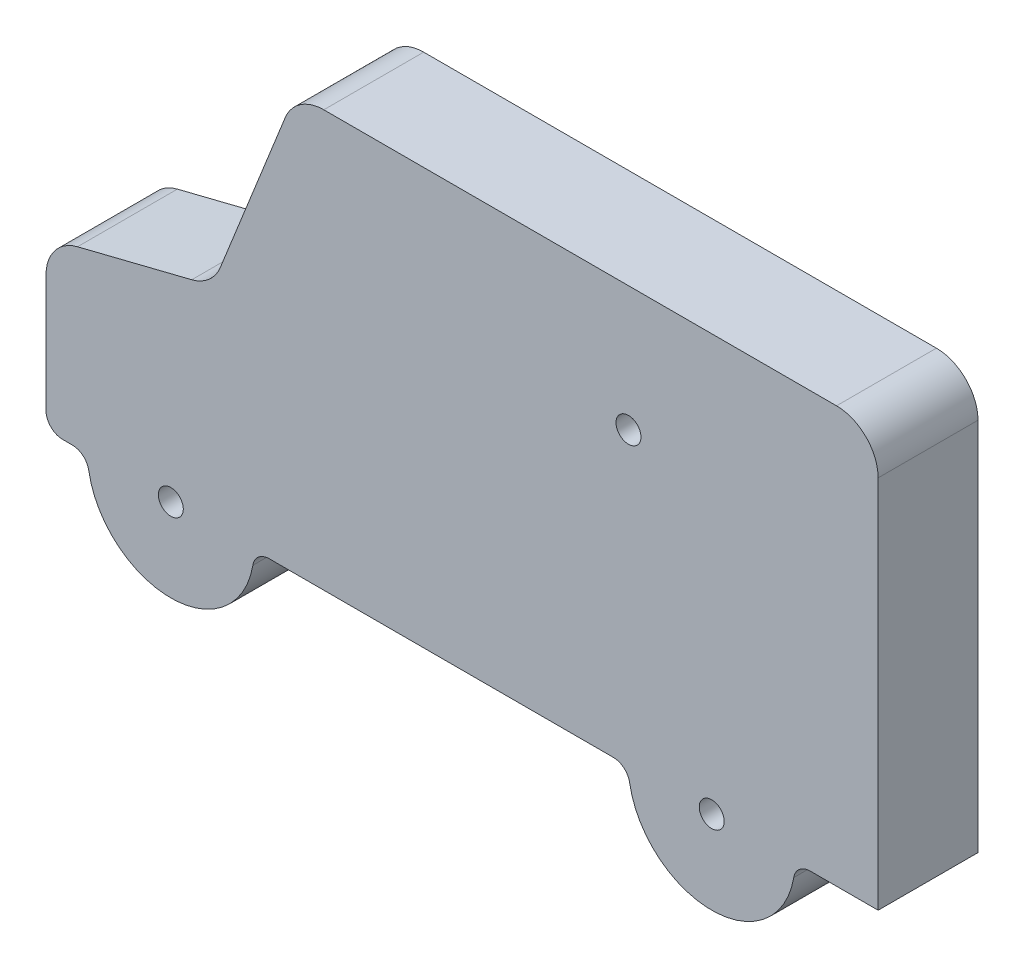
ISO-10303-21;
HEADER;
FILE_DESCRIPTION(('STEP AP214'),'2;1');
FILE_NAME('part.step','',(''),(''),'','','');
FILE_SCHEMA(('AUTOMOTIVE_DESIGN { 1 0 10303 214 1 1 1 1 }'));
ENDSEC;
DATA;
#1=APPLICATION_CONTEXT('core data for automotive mechanical design processes');
#2=APPLICATION_PROTOCOL_DEFINITION('international standard','automotive_design',2000,#1);
#3=PRODUCT_CONTEXT('',#1,'mechanical');
#4=PRODUCT('Part','Part','',(#3));
#5=PRODUCT_RELATED_PRODUCT_CATEGORY('part','',(#4));
#6=PRODUCT_DEFINITION_FORMATION('','',#4);
#7=PRODUCT_DEFINITION_CONTEXT('part definition',#1,'design');
#8=PRODUCT_DEFINITION('design','',#6,#7);
#9=PRODUCT_DEFINITION_SHAPE('','',#8);
#10=(LENGTH_UNIT() NAMED_UNIT(*) SI_UNIT(.MILLI.,.METRE.));
#11=(NAMED_UNIT(*) PLANE_ANGLE_UNIT() SI_UNIT($,.RADIAN.));
#12=(NAMED_UNIT(*) SI_UNIT($,.STERADIAN.) SOLID_ANGLE_UNIT());
#13=UNCERTAINTY_MEASURE_WITH_UNIT(LENGTH_MEASURE(1.E-05),#10,'distance_accuracy_value','');
#14=(GEOMETRIC_REPRESENTATION_CONTEXT(3) GLOBAL_UNCERTAINTY_ASSIGNED_CONTEXT((#13)) GLOBAL_UNIT_ASSIGNED_CONTEXT((#10,
#11,#12)) REPRESENTATION_CONTEXT('',''));
#15=CARTESIAN_POINT('',(0.,0.,0.));
#16=DIRECTION('',(0.,0.,1.));
#17=DIRECTION('',(1.,0.,0.));
#18=AXIS2_PLACEMENT_3D('',#15,#16,#17);
#19=CARTESIAN_POINT('',(33.3851648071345,45.,12.));
#20=DIRECTION('',(0.,0.,-1.));
#21=DIRECTION('',(-1.,0.,0.));
#22=AXIS2_PLACEMENT_3D('',#19,#20,#21);
#23=PLANE('',#22);
#24=CARTESIAN_POINT('',(70.,35.,12.));
#25=DIRECTION('',(0.,0.,1.));
#26=DIRECTION('',(1.,0.,0.));
#27=AXIS2_PLACEMENT_3D('',#24,#25,#26);
#28=CIRCLE('',#27,1.5);
#29=CARTESIAN_POINT('',(71.5,35.,12.));
#30=VERTEX_POINT('',#29);
#31=EDGE_CURVE('E417',#30,#30,#28,.T.);
#32=ORIENTED_EDGE('',*,*,#31,.F.);
#33=EDGE_LOOP('',(#32));
#34=FACE_BOUND('',#33,.T.);
#35=CARTESIAN_POINT('',(15.,0.,12.));
#36=DIRECTION('',(0.,0.,1.));
#37=DIRECTION('',(1.,0.,0.));
#38=AXIS2_PLACEMENT_3D('',#35,#36,#37);
#39=CIRCLE('',#38,1.5);
#40=CARTESIAN_POINT('',(16.5,0.,12.));
#41=VERTEX_POINT('',#40);
#42=EDGE_CURVE('E177',#41,#41,#39,.T.);
#43=ORIENTED_EDGE('',*,*,#42,.F.);
#44=EDGE_LOOP('',(#43));
#45=FACE_BOUND('',#44,.T.);
#46=CARTESIAN_POINT('',(33.3851648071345,45.,12.));
#47=DIRECTION('',(0.,0.,1.));
#48=DIRECTION('',(-1.,0.,0.));
#49=AXIS2_PLACEMENT_3D('',#46,#47,#48);
#50=CIRCLE('',#49,5.);
#51=CARTESIAN_POINT('',(33.3851648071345,50.,12.));
#52=VERTEX_POINT('',#51);
#53=CARTESIAN_POINT('',(28.7427813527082,46.8569533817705,12.));
#54=VERTEX_POINT('',#53);
#55=EDGE_CURVE('E217',#52,#54,#50,.T.);
#56=ORIENTED_EDGE('',*,*,#55,.T.);
#57=DIRECTION('',(-0.371390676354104,-0.928476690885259,0.));
#58=VECTOR('',#57,1.);
#59=CARTESIAN_POINT('',(20.9494812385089,27.3737030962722,12.));
#60=LINE('',#59,#58);
#61=CARTESIAN_POINT('',(20.9494812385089,27.3737030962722,12.));
#62=VERTEX_POINT('',#61);
#63=EDGE_CURVE('E172',#54,#62,#60,.T.);
#64=ORIENTED_EDGE('',*,*,#63,.T.);
#65=CARTESIAN_POINT('',(16.3070977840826,29.2306564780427,12.));
#66=DIRECTION('',(0.,0.,-1.));
#67=DIRECTION('',(1.,0.,0.));
#68=AXIS2_PLACEMENT_3D('',#65,#66,#67);
#69=CIRCLE('',#68,5.);
#70=CARTESIAN_POINT('',(17.5197759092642,24.3799439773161,12.));
#71=VERTEX_POINT('',#70);
#72=EDGE_CURVE('E220',#62,#71,#69,.T.);
#73=ORIENTED_EDGE('',*,*,#72,.T.);
#74=DIRECTION('',(-0.970142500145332,-0.242535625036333,0.));
#75=VECTOR('',#74,1.);
#76=CARTESIAN_POINT('',(3.78732187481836,20.9468304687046,12.));
#77=LINE('',#76,#75);
#78=CARTESIAN_POINT('',(3.78732187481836,20.9468304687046,12.));
#79=VERTEX_POINT('',#78);
#80=EDGE_CURVE('E222',#71,#79,#77,.T.);
#81=ORIENTED_EDGE('',*,*,#80,.T.);
#82=CARTESIAN_POINT('',(5.,16.0961179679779,12.));
#83=DIRECTION('',(0.,0.,1.));
#84=DIRECTION('',(1.,0.,0.));
#85=AXIS2_PLACEMENT_3D('',#82,#83,#84);
#86=CIRCLE('',#85,5.);
#87=CARTESIAN_POINT('',(0.,16.0961179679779,12.));
#88=VERTEX_POINT('',#87);
#89=EDGE_CURVE('E224',#79,#88,#86,.T.);
#90=ORIENTED_EDGE('',*,*,#89,.T.);
#91=DIRECTION('',(0.,-1.,0.));
#92=VECTOR('',#91,1.);
#93=CARTESIAN_POINT('',(0.,2.00000000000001,12.));
#94=LINE('',#93,#92);
#95=CARTESIAN_POINT('',(0.,2.00000000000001,12.));
#96=VERTEX_POINT('',#95);
#97=EDGE_CURVE('E226',#88,#96,#94,.T.);
#98=ORIENTED_EDGE('',*,*,#97,.T.);
#99=CARTESIAN_POINT('',(2.,2.,12.));
#100=DIRECTION('',(0.,0.,1.));
#101=DIRECTION('',(-1.,0.,0.));
#102=AXIS2_PLACEMENT_3D('',#99,#100,#101);
#103=CIRCLE('',#102,2.);
#104=CARTESIAN_POINT('',(2.00000000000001,0.,12.));
#105=VERTEX_POINT('',#104);
#106=EDGE_CURVE('E228',#96,#105,#103,.T.);
#107=ORIENTED_EDGE('',*,*,#106,.T.);
#108=DIRECTION('',(1.,0.,0.));
#109=VECTOR('',#108,1.);
#110=CARTESIAN_POINT('',(2.00000000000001,0.,12.));
#111=LINE('',#110,#109);
#112=CARTESIAN_POINT('',(3.16784043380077,0.,12.));
#113=VERTEX_POINT('',#112);
#114=EDGE_CURVE('E230',#105,#113,#111,.T.);
#115=ORIENTED_EDGE('',*,*,#114,.T.);
#116=CARTESIAN_POINT('',(3.16784043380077,-2.,12.));
#117=DIRECTION('',(0.,0.,-1.));
#118=DIRECTION('',(1.,0.,0.));
#119=AXIS2_PLACEMENT_3D('',#116,#117,#118);
#120=CIRCLE('',#119,2.);
#121=CARTESIAN_POINT('',(5.13986702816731,-1.66666666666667,12.));
#122=VERTEX_POINT('',#121);
#123=EDGE_CURVE('E232',#113,#122,#120,.T.);
#124=ORIENTED_EDGE('',*,*,#123,.T.);
#125=CARTESIAN_POINT('',(15.,0.,12.));
#126=DIRECTION('',(0.,0.,1.));
#127=DIRECTION('',(1.,0.,0.));
#128=AXIS2_PLACEMENT_3D('',#125,#126,#127);
#129=CIRCLE('',#128,10.);
#130=CARTESIAN_POINT('',(24.8601329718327,-1.66666666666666,12.));
#131=VERTEX_POINT('',#130);
#132=EDGE_CURVE('E234',#122,#131,#129,.T.);
#133=ORIENTED_EDGE('',*,*,#132,.T.);
#134=CARTESIAN_POINT('',(26.8321595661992,-2.,12.));
#135=DIRECTION('',(0.,0.,-1.));
#136=DIRECTION('',(1.,0.,0.));
#137=AXIS2_PLACEMENT_3D('',#134,#135,#136);
#138=CIRCLE('',#137,2.);
#139=CARTESIAN_POINT('',(26.8321595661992,0.,12.));
#140=VERTEX_POINT('',#139);
#141=EDGE_CURVE('E236',#131,#140,#138,.T.);
#142=ORIENTED_EDGE('',*,*,#141,.T.);
#143=DIRECTION('',(1.,0.,0.));
#144=VECTOR('',#143,1.);
#145=CARTESIAN_POINT('',(26.8321595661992,0.,12.));
#146=LINE('',#145,#144);
#147=CARTESIAN_POINT('',(68.1678404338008,0.,12.));
#148=VERTEX_POINT('',#147);
#149=EDGE_CURVE('E238',#140,#148,#146,.T.);
#150=ORIENTED_EDGE('',*,*,#149,.T.);
#151=CARTESIAN_POINT('',(68.1678404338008,-2.,12.));
#152=DIRECTION('',(0.,0.,-1.));
#153=DIRECTION('',(-1.,0.,0.));
#154=AXIS2_PLACEMENT_3D('',#151,#152,#153);
#155=CIRCLE('',#154,2.);
#156=CARTESIAN_POINT('',(70.1398670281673,-1.66666666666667,12.));
#157=VERTEX_POINT('',#156);
#158=EDGE_CURVE('E240',#148,#157,#155,.T.);
#159=ORIENTED_EDGE('',*,*,#158,.T.);
#160=CARTESIAN_POINT('',(80.,0.,12.));
#161=DIRECTION('',(0.,0.,1.));
#162=DIRECTION('',(1.,0.,0.));
#163=AXIS2_PLACEMENT_3D('',#160,#161,#162);
#164=CIRCLE('',#163,10.);
#165=CARTESIAN_POINT('',(89.8601329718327,-1.66666666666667,12.));
#166=VERTEX_POINT('',#165);
#167=EDGE_CURVE('E242',#157,#166,#164,.T.);
#168=ORIENTED_EDGE('',*,*,#167,.T.);
#169=CARTESIAN_POINT('',(91.8321595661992,-2.,12.));
#170=DIRECTION('',(0.,0.,-1.));
#171=DIRECTION('',(1.,0.,0.));
#172=AXIS2_PLACEMENT_3D('',#169,#170,#171);
#173=CIRCLE('',#172,2.);
#174=CARTESIAN_POINT('',(91.8321595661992,0.,12.));
#175=VERTEX_POINT('',#174);
#176=EDGE_CURVE('E244',#166,#175,#173,.T.);
#177=ORIENTED_EDGE('',*,*,#176,.T.);
#178=DIRECTION('',(1.,0.,0.));
#179=VECTOR('',#178,1.);
#180=CARTESIAN_POINT('',(91.8321595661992,0.,12.));
#181=LINE('',#180,#179);
#182=CARTESIAN_POINT('',(100.,0.,12.));
#183=VERTEX_POINT('',#182);
#184=EDGE_CURVE('E246',#175,#183,#181,.T.);
#185=ORIENTED_EDGE('',*,*,#184,.T.);
#186=DIRECTION('',(0.,1.,0.));
#187=VECTOR('',#186,1.);
#188=CARTESIAN_POINT('',(100.,0.,12.));
#189=LINE('',#188,#187);
#190=CARTESIAN_POINT('',(100.,45.,12.));
#191=VERTEX_POINT('',#190);
#192=EDGE_CURVE('E248',#183,#191,#189,.T.);
#193=ORIENTED_EDGE('',*,*,#192,.T.);
#194=CARTESIAN_POINT('',(95.,45.,12.));
#195=DIRECTION('',(0.,0.,1.));
#196=DIRECTION('',(-1.,0.,0.));
#197=AXIS2_PLACEMENT_3D('',#194,#195,#196);
#198=CIRCLE('',#197,5.);
#199=CARTESIAN_POINT('',(95.,50.,12.));
#200=VERTEX_POINT('',#199);
#201=EDGE_CURVE('E47',#191,#200,#198,.T.);
#202=ORIENTED_EDGE('',*,*,#201,.T.);
#203=DIRECTION('',(-1.,0.,0.));
#204=VECTOR('',#203,1.);
#205=CARTESIAN_POINT('',(33.3851648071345,50.,12.));
#206=LINE('',#205,#204);
#207=EDGE_CURVE('E42',#200,#52,#206,.T.);
#208=ORIENTED_EDGE('',*,*,#207,.T.);
#209=EDGE_LOOP('',(#56,#64,#73,#81,#90,#98,#107,#115,#124,#133,#142,#150,#159,#168,#177,#185,
#193,#202,#208));
#210=FACE_BOUND('',#209,.T.);
#211=CARTESIAN_POINT('',(80.,0.,12.));
#212=DIRECTION('',(0.,0.,1.));
#213=DIRECTION('',(1.,0.,0.));
#214=AXIS2_PLACEMENT_3D('',#211,#212,#213);
#215=CIRCLE('',#214,1.5);
#216=CARTESIAN_POINT('',(81.5,0.,12.));
#217=VERTEX_POINT('',#216);
#218=EDGE_CURVE('E420',#217,#217,#215,.T.);
#219=ORIENTED_EDGE('',*,*,#218,.F.);
#220=EDGE_LOOP('',(#219));
#221=FACE_BOUND('',#220,.T.);
#222=ADVANCED_FACE('F27',(#34,#45,#210,#221),#23,.F.);
#223=CARTESIAN_POINT('',(33.3851648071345,45.,0.));
#224=DIRECTION('',(0.,0.,-1.));
#225=DIRECTION('',(-1.,0.,0.));
#226=AXIS2_PLACEMENT_3D('',#223,#224,#225);
#227=PLANE('',#226);
#228=CARTESIAN_POINT('',(15.,0.,0.));
#229=DIRECTION('',(0.,0.,1.));
#230=DIRECTION('',(1.,0.,0.));
#231=AXIS2_PLACEMENT_3D('',#228,#229,#230);
#232=CIRCLE('',#231,1.5);
#233=CARTESIAN_POINT('',(16.5,0.,0.));
#234=VERTEX_POINT('',#233);
#235=EDGE_CURVE('E180',#234,#234,#232,.T.);
#236=ORIENTED_EDGE('',*,*,#235,.T.);
#237=EDGE_LOOP('',(#236));
#238=FACE_BOUND('',#237,.T.);
#239=CARTESIAN_POINT('',(33.3851648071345,45.,0.));
#240=DIRECTION('',(0.,0.,1.));
#241=DIRECTION('',(-1.,0.,0.));
#242=AXIS2_PLACEMENT_3D('',#239,#240,#241);
#243=CIRCLE('',#242,5.);
#244=CARTESIAN_POINT('',(33.3851648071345,50.,0.));
#245=VERTEX_POINT('',#244);
#246=CARTESIAN_POINT('',(28.7427813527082,46.8569533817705,0.));
#247=VERTEX_POINT('',#246);
#248=EDGE_CURVE('E163',#245,#247,#243,.T.);
#249=ORIENTED_EDGE('',*,*,#248,.F.);
#250=DIRECTION('',(-1.,0.,0.));
#251=VECTOR('',#250,1.);
#252=CARTESIAN_POINT('',(33.3851648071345,50.,0.));
#253=LINE('',#252,#251);
#254=CARTESIAN_POINT('',(95.,50.,0.));
#255=VERTEX_POINT('',#254);
#256=EDGE_CURVE('E215',#255,#245,#253,.T.);
#257=ORIENTED_EDGE('',*,*,#256,.F.);
#258=CARTESIAN_POINT('',(95.,45.,0.));
#259=DIRECTION('',(0.,0.,1.));
#260=DIRECTION('',(-1.,0.,0.));
#261=AXIS2_PLACEMENT_3D('',#258,#259,#260);
#262=CIRCLE('',#261,5.);
#263=CARTESIAN_POINT('',(100.,45.,0.));
#264=VERTEX_POINT('',#263);
#265=EDGE_CURVE('E213',#264,#255,#262,.T.);
#266=ORIENTED_EDGE('',*,*,#265,.F.);
#267=DIRECTION('',(0.,1.,0.));
#268=VECTOR('',#267,1.);
#269=CARTESIAN_POINT('',(100.,0.,0.));
#270=LINE('',#269,#268);
#271=CARTESIAN_POINT('',(100.,0.,0.));
#272=VERTEX_POINT('',#271);
#273=EDGE_CURVE('E211',#272,#264,#270,.T.);
#274=ORIENTED_EDGE('',*,*,#273,.F.);
#275=DIRECTION('',(1.,0.,0.));
#276=VECTOR('',#275,1.);
#277=CARTESIAN_POINT('',(91.8321595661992,0.,0.));
#278=LINE('',#277,#276);
#279=CARTESIAN_POINT('',(91.8321595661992,0.,0.));
#280=VERTEX_POINT('',#279);
#281=EDGE_CURVE('E209',#280,#272,#278,.T.);
#282=ORIENTED_EDGE('',*,*,#281,.F.);
#283=CARTESIAN_POINT('',(91.8321595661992,-2.,0.));
#284=DIRECTION('',(0.,0.,-1.));
#285=DIRECTION('',(1.,0.,0.));
#286=AXIS2_PLACEMENT_3D('',#283,#284,#285);
#287=CIRCLE('',#286,2.);
#288=CARTESIAN_POINT('',(89.8601329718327,-1.66666666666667,0.));
#289=VERTEX_POINT('',#288);
#290=EDGE_CURVE('E207',#289,#280,#287,.T.);
#291=ORIENTED_EDGE('',*,*,#290,.F.);
#292=CARTESIAN_POINT('',(80.,0.,0.));
#293=DIRECTION('',(0.,0.,1.));
#294=DIRECTION('',(1.,0.,0.));
#295=AXIS2_PLACEMENT_3D('',#292,#293,#294);
#296=CIRCLE('',#295,10.);
#297=CARTESIAN_POINT('',(70.1398670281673,-1.66666666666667,0.));
#298=VERTEX_POINT('',#297);
#299=EDGE_CURVE('E205',#298,#289,#296,.T.);
#300=ORIENTED_EDGE('',*,*,#299,.F.);
#301=CARTESIAN_POINT('',(68.1678404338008,-2.,0.));
#302=DIRECTION('',(0.,0.,-1.));
#303=DIRECTION('',(-1.,0.,0.));
#304=AXIS2_PLACEMENT_3D('',#301,#302,#303);
#305=CIRCLE('',#304,2.);
#306=CARTESIAN_POINT('',(68.1678404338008,0.,0.));
#307=VERTEX_POINT('',#306);
#308=EDGE_CURVE('E203',#307,#298,#305,.T.);
#309=ORIENTED_EDGE('',*,*,#308,.F.);
#310=DIRECTION('',(1.,0.,0.));
#311=VECTOR('',#310,1.);
#312=CARTESIAN_POINT('',(26.8321595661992,0.,0.));
#313=LINE('',#312,#311);
#314=CARTESIAN_POINT('',(26.8321595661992,0.,0.));
#315=VERTEX_POINT('',#314);
#316=EDGE_CURVE('E201',#315,#307,#313,.T.);
#317=ORIENTED_EDGE('',*,*,#316,.F.);
#318=CARTESIAN_POINT('',(26.8321595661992,-2.,0.));
#319=DIRECTION('',(0.,0.,-1.));
#320=DIRECTION('',(1.,0.,0.));
#321=AXIS2_PLACEMENT_3D('',#318,#319,#320);
#322=CIRCLE('',#321,2.);
#323=CARTESIAN_POINT('',(24.8601329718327,-1.66666666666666,0.));
#324=VERTEX_POINT('',#323);
#325=EDGE_CURVE('E199',#324,#315,#322,.T.);
#326=ORIENTED_EDGE('',*,*,#325,.F.);
#327=CARTESIAN_POINT('',(15.,0.,0.));
#328=DIRECTION('',(0.,0.,1.));
#329=DIRECTION('',(1.,0.,0.));
#330=AXIS2_PLACEMENT_3D('',#327,#328,#329);
#331=CIRCLE('',#330,10.);
#332=CARTESIAN_POINT('',(5.13986702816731,-1.66666666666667,0.));
#333=VERTEX_POINT('',#332);
#334=EDGE_CURVE('E197',#333,#324,#331,.T.);
#335=ORIENTED_EDGE('',*,*,#334,.F.);
#336=CARTESIAN_POINT('',(3.16784043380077,-2.,0.));
#337=DIRECTION('',(0.,0.,-1.));
#338=DIRECTION('',(1.,0.,0.));
#339=AXIS2_PLACEMENT_3D('',#336,#337,#338);
#340=CIRCLE('',#339,2.);
#341=CARTESIAN_POINT('',(3.16784043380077,0.,0.));
#342=VERTEX_POINT('',#341);
#343=EDGE_CURVE('E195',#342,#333,#340,.T.);
#344=ORIENTED_EDGE('',*,*,#343,.F.);
#345=DIRECTION('',(1.,0.,0.));
#346=VECTOR('',#345,1.);
#347=CARTESIAN_POINT('',(2.00000000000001,0.,0.));
#348=LINE('',#347,#346);
#349=CARTESIAN_POINT('',(2.00000000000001,0.,0.));
#350=VERTEX_POINT('',#349);
#351=EDGE_CURVE('E193',#350,#342,#348,.T.);
#352=ORIENTED_EDGE('',*,*,#351,.F.);
#353=CARTESIAN_POINT('',(2.,2.,0.));
#354=DIRECTION('',(0.,0.,1.));
#355=DIRECTION('',(-1.,0.,0.));
#356=AXIS2_PLACEMENT_3D('',#353,#354,#355);
#357=CIRCLE('',#356,2.);
#358=CARTESIAN_POINT('',(0.,2.00000000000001,0.));
#359=VERTEX_POINT('',#358);
#360=EDGE_CURVE('E191',#359,#350,#357,.T.);
#361=ORIENTED_EDGE('',*,*,#360,.F.);
#362=DIRECTION('',(0.,-1.,0.));
#363=VECTOR('',#362,1.);
#364=CARTESIAN_POINT('',(0.,2.00000000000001,0.));
#365=LINE('',#364,#363);
#366=CARTESIAN_POINT('',(0.,16.0961179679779,0.));
#367=VERTEX_POINT('',#366);
#368=EDGE_CURVE('E189',#367,#359,#365,.T.);
#369=ORIENTED_EDGE('',*,*,#368,.F.);
#370=CARTESIAN_POINT('',(5.,16.0961179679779,0.));
#371=DIRECTION('',(0.,0.,1.));
#372=DIRECTION('',(1.,0.,0.));
#373=AXIS2_PLACEMENT_3D('',#370,#371,#372);
#374=CIRCLE('',#373,5.);
#375=CARTESIAN_POINT('',(3.78732187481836,20.9468304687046,0.));
#376=VERTEX_POINT('',#375);
#377=EDGE_CURVE('E187',#376,#367,#374,.T.);
#378=ORIENTED_EDGE('',*,*,#377,.F.);
#379=DIRECTION('',(-0.970142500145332,-0.242535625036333,0.));
#380=VECTOR('',#379,1.);
#381=CARTESIAN_POINT('',(3.78732187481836,20.9468304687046,0.));
#382=LINE('',#381,#380);
#383=CARTESIAN_POINT('',(17.5197759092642,24.3799439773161,0.));
#384=VERTEX_POINT('',#383);
#385=EDGE_CURVE('E185',#384,#376,#382,.T.);
#386=ORIENTED_EDGE('',*,*,#385,.F.);
#387=CARTESIAN_POINT('',(16.3070977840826,29.2306564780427,0.));
#388=DIRECTION('',(0.,0.,-1.));
#389=DIRECTION('',(1.,0.,0.));
#390=AXIS2_PLACEMENT_3D('',#387,#388,#389);
#391=CIRCLE('',#390,5.);
#392=CARTESIAN_POINT('',(20.9494812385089,27.3737030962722,0.));
#393=VERTEX_POINT('',#392);
#394=EDGE_CURVE('E165',#393,#384,#391,.T.);
#395=ORIENTED_EDGE('',*,*,#394,.F.);
#396=DIRECTION('',(-0.371390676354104,-0.928476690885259,0.));
#397=VECTOR('',#396,1.);
#398=CARTESIAN_POINT('',(20.9494812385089,27.3737030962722,0.));
#399=LINE('',#398,#397);
#400=EDGE_CURVE('E158',#247,#393,#399,.T.);
#401=ORIENTED_EDGE('',*,*,#400,.F.);
#402=EDGE_LOOP('',(#249,#257,#266,#274,#282,#291,#300,#309,#317,#326,#335,#344,#352,#361,#369,
#378,#386,#395,#401));
#403=FACE_BOUND('',#402,.T.);
#404=CARTESIAN_POINT('',(80.,0.,0.));
#405=DIRECTION('',(0.,0.,1.));
#406=DIRECTION('',(1.,0.,0.));
#407=AXIS2_PLACEMENT_3D('',#404,#405,#406);
#408=CIRCLE('',#407,1.5);
#409=CARTESIAN_POINT('',(81.5,0.,0.));
#410=VERTEX_POINT('',#409);
#411=EDGE_CURVE('E416',#410,#410,#408,.T.);
#412=ORIENTED_EDGE('',*,*,#411,.T.);
#413=EDGE_LOOP('',(#412));
#414=FACE_BOUND('',#413,.T.);
#415=ADVANCED_FACE('F159',(#238,#403,#414),#227,.T.);
#416=CARTESIAN_POINT('',(33.3851648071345,45.,12.));
#417=DIRECTION('',(0.,0.,-1.));
#418=DIRECTION('',(-1.,0.,0.));
#419=AXIS2_PLACEMENT_3D('',#416,#417,#418);
#420=CYLINDRICAL_SURFACE('',#419,5.);
#421=ORIENTED_EDGE('',*,*,#248,.T.);
#422=DIRECTION('',(0.,0.,-1.));
#423=VECTOR('',#422,1.);
#424=CARTESIAN_POINT('',(28.7427813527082,46.8569533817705,12.));
#425=LINE('',#424,#423);
#426=EDGE_CURVE('E11',#54,#247,#425,.T.);
#427=ORIENTED_EDGE('',*,*,#426,.F.);
#428=ORIENTED_EDGE('',*,*,#55,.F.);
#429=DIRECTION('',(0.,0.,-1.));
#430=VECTOR('',#429,1.);
#431=CARTESIAN_POINT('',(33.3851648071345,50.,12.));
#432=LINE('',#431,#430);
#433=EDGE_CURVE('E176',#52,#245,#432,.T.);
#434=ORIENTED_EDGE('',*,*,#433,.T.);
#435=EDGE_LOOP('',(#421,#427,#428,#434));
#436=FACE_BOUND('',#435,.T.);
#437=ADVANCED_FACE('F29',(#436),#420,.T.);
#438=CARTESIAN_POINT('',(20.9494812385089,27.3737030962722,12.));
#439=DIRECTION('',(0.928476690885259,-0.371390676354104,0.));
#440=DIRECTION('',(0.371390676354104,0.928476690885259,0.));
#441=AXIS2_PLACEMENT_3D('',#438,#439,#440);
#442=PLANE('',#441);
#443=ORIENTED_EDGE('',*,*,#400,.T.);
#444=DIRECTION('',(0.,0.,-1.));
#445=VECTOR('',#444,1.);
#446=CARTESIAN_POINT('',(20.9494812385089,27.3737030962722,12.));
#447=LINE('',#446,#445);
#448=EDGE_CURVE('E35',#62,#393,#447,.T.);
#449=ORIENTED_EDGE('',*,*,#448,.F.);
#450=ORIENTED_EDGE('',*,*,#63,.F.);
#451=ORIENTED_EDGE('',*,*,#426,.T.);
#452=EDGE_LOOP('',(#443,#449,#450,#451));
#453=FACE_BOUND('',#452,.T.);
#454=ADVANCED_FACE('F171',(#453),#442,.F.);
#455=CARTESIAN_POINT('',(16.3070977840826,29.2306564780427,12.));
#456=DIRECTION('',(0.,0.,-1.));
#457=DIRECTION('',(-1.,0.,0.));
#458=AXIS2_PLACEMENT_3D('',#455,#456,#457);
#459=CYLINDRICAL_SURFACE('',#458,5.);
#460=ORIENTED_EDGE('',*,*,#394,.T.);
#461=DIRECTION('',(0.,0.,-1.));
#462=VECTOR('',#461,1.);
#463=CARTESIAN_POINT('',(17.5197759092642,24.3799439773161,12.));
#464=LINE('',#463,#462);
#465=EDGE_CURVE('E298',#71,#384,#464,.T.);
#466=ORIENTED_EDGE('',*,*,#465,.F.);
#467=ORIENTED_EDGE('',*,*,#72,.F.);
#468=ORIENTED_EDGE('',*,*,#448,.T.);
#469=EDGE_LOOP('',(#460,#466,#467,#468));
#470=FACE_BOUND('',#469,.T.);
#471=ADVANCED_FACE('F302',(#470),#459,.F.);
#472=CARTESIAN_POINT('',(3.78732187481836,20.9468304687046,12.));
#473=DIRECTION('',(0.242535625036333,-0.970142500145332,0.));
#474=DIRECTION('',(0.970142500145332,0.242535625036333,0.));
#475=AXIS2_PLACEMENT_3D('',#472,#473,#474);
#476=PLANE('',#475);
#477=ORIENTED_EDGE('',*,*,#385,.T.);
#478=DIRECTION('',(0.,0.,-1.));
#479=VECTOR('',#478,1.);
#480=CARTESIAN_POINT('',(3.78732187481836,20.9468304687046,12.));
#481=LINE('',#480,#479);
#482=EDGE_CURVE('E295',#79,#376,#481,.T.);
#483=ORIENTED_EDGE('',*,*,#482,.F.);
#484=ORIENTED_EDGE('',*,*,#80,.F.);
#485=ORIENTED_EDGE('',*,*,#465,.T.);
#486=EDGE_LOOP('',(#477,#483,#484,#485));
#487=FACE_BOUND('',#486,.T.);
#488=ADVANCED_FACE('F310',(#487),#476,.F.);
#489=CARTESIAN_POINT('',(5.,16.0961179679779,12.));
#490=DIRECTION('',(0.,0.,-1.));
#491=DIRECTION('',(-1.,0.,0.));
#492=AXIS2_PLACEMENT_3D('',#489,#490,#491);
#493=CYLINDRICAL_SURFACE('',#492,5.);
#494=ORIENTED_EDGE('',*,*,#377,.T.);
#495=DIRECTION('',(0.,0.,-1.));
#496=VECTOR('',#495,1.);
#497=CARTESIAN_POINT('',(0.,16.0961179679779,12.));
#498=LINE('',#497,#496);
#499=EDGE_CURVE('E292',#88,#367,#498,.T.);
#500=ORIENTED_EDGE('',*,*,#499,.F.);
#501=ORIENTED_EDGE('',*,*,#89,.F.);
#502=ORIENTED_EDGE('',*,*,#482,.T.);
#503=EDGE_LOOP('',(#494,#500,#501,#502));
#504=FACE_BOUND('',#503,.T.);
#505=ADVANCED_FACE('F313',(#504),#493,.T.);
#506=CARTESIAN_POINT('',(0.,2.00000000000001,12.));
#507=DIRECTION('',(1.,0.,0.));
#508=DIRECTION('',(0.,0.,-1.));
#509=AXIS2_PLACEMENT_3D('',#506,#507,#508);
#510=PLANE('',#509);
#511=ORIENTED_EDGE('',*,*,#368,.T.);
#512=DIRECTION('',(0.,0.,-1.));
#513=VECTOR('',#512,1.);
#514=CARTESIAN_POINT('',(0.,2.00000000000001,12.));
#515=LINE('',#514,#513);
#516=EDGE_CURVE('E289',#96,#359,#515,.T.);
#517=ORIENTED_EDGE('',*,*,#516,.F.);
#518=ORIENTED_EDGE('',*,*,#97,.F.);
#519=ORIENTED_EDGE('',*,*,#499,.T.);
#520=EDGE_LOOP('',(#511,#517,#518,#519));
#521=FACE_BOUND('',#520,.T.);
#522=ADVANCED_FACE('F318',(#521),#510,.F.);
#523=CARTESIAN_POINT('',(2.,2.,12.));
#524=DIRECTION('',(0.,0.,-1.));
#525=DIRECTION('',(-1.,0.,0.));
#526=AXIS2_PLACEMENT_3D('',#523,#524,#525);
#527=CYLINDRICAL_SURFACE('',#526,2.);
#528=ORIENTED_EDGE('',*,*,#360,.T.);
#529=DIRECTION('',(0.,0.,-1.));
#530=VECTOR('',#529,1.);
#531=CARTESIAN_POINT('',(2.00000000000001,0.,12.));
#532=LINE('',#531,#530);
#533=EDGE_CURVE('E286',#105,#350,#532,.T.);
#534=ORIENTED_EDGE('',*,*,#533,.F.);
#535=ORIENTED_EDGE('',*,*,#106,.F.);
#536=ORIENTED_EDGE('',*,*,#516,.T.);
#537=EDGE_LOOP('',(#528,#534,#535,#536));
#538=FACE_BOUND('',#537,.T.);
#539=ADVANCED_FACE('F324',(#538),#527,.T.);
#540=CARTESIAN_POINT('',(2.00000000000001,0.,12.));
#541=DIRECTION('',(0.,1.,0.));
#542=DIRECTION('',(0.,0.,1.));
#543=AXIS2_PLACEMENT_3D('',#540,#541,#542);
#544=PLANE('',#543);
#545=ORIENTED_EDGE('',*,*,#351,.T.);
#546=DIRECTION('',(0.,0.,-1.));
#547=VECTOR('',#546,1.);
#548=CARTESIAN_POINT('',(3.16784043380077,0.,12.));
#549=LINE('',#548,#547);
#550=EDGE_CURVE('E283',#113,#342,#549,.T.);
#551=ORIENTED_EDGE('',*,*,#550,.F.);
#552=ORIENTED_EDGE('',*,*,#114,.F.);
#553=ORIENTED_EDGE('',*,*,#533,.T.);
#554=EDGE_LOOP('',(#545,#551,#552,#553));
#555=FACE_BOUND('',#554,.T.);
#556=ADVANCED_FACE('F328',(#555),#544,.F.);
#557=CARTESIAN_POINT('',(3.16784043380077,-2.,12.));
#558=DIRECTION('',(0.,0.,-1.));
#559=DIRECTION('',(-1.,0.,0.));
#560=AXIS2_PLACEMENT_3D('',#557,#558,#559);
#561=CYLINDRICAL_SURFACE('',#560,2.);
#562=ORIENTED_EDGE('',*,*,#343,.T.);
#563=DIRECTION('',(0.,0.,-1.));
#564=VECTOR('',#563,1.);
#565=CARTESIAN_POINT('',(5.13986702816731,-1.66666666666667,12.));
#566=LINE('',#565,#564);
#567=EDGE_CURVE('E280',#122,#333,#566,.T.);
#568=ORIENTED_EDGE('',*,*,#567,.F.);
#569=ORIENTED_EDGE('',*,*,#123,.F.);
#570=ORIENTED_EDGE('',*,*,#550,.T.);
#571=EDGE_LOOP('',(#562,#568,#569,#570));
#572=FACE_BOUND('',#571,.T.);
#573=ADVANCED_FACE('F333',(#572),#561,.F.);
#574=CARTESIAN_POINT('',(15.,0.,12.));
#575=DIRECTION('',(0.,0.,-1.));
#576=DIRECTION('',(-1.,0.,0.));
#577=AXIS2_PLACEMENT_3D('',#574,#575,#576);
#578=CYLINDRICAL_SURFACE('',#577,10.);
#579=ORIENTED_EDGE('',*,*,#334,.T.);
#580=DIRECTION('',(0.,0.,-1.));
#581=VECTOR('',#580,1.);
#582=CARTESIAN_POINT('',(24.8601329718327,-1.66666666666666,12.));
#583=LINE('',#582,#581);
#584=EDGE_CURVE('E277',#131,#324,#583,.T.);
#585=ORIENTED_EDGE('',*,*,#584,.F.);
#586=ORIENTED_EDGE('',*,*,#132,.F.);
#587=ORIENTED_EDGE('',*,*,#567,.T.);
#588=EDGE_LOOP('',(#579,#585,#586,#587));
#589=FACE_BOUND('',#588,.T.);
#590=ADVANCED_FACE('F339',(#589),#578,.T.);
#591=CARTESIAN_POINT('',(26.8321595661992,-2.,12.));
#592=DIRECTION('',(0.,0.,-1.));
#593=DIRECTION('',(-1.,0.,0.));
#594=AXIS2_PLACEMENT_3D('',#591,#592,#593);
#595=CYLINDRICAL_SURFACE('',#594,2.);
#596=ORIENTED_EDGE('',*,*,#325,.T.);
#597=DIRECTION('',(0.,0.,-1.));
#598=VECTOR('',#597,1.);
#599=CARTESIAN_POINT('',(26.8321595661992,0.,12.));
#600=LINE('',#599,#598);
#601=EDGE_CURVE('E274',#140,#315,#600,.T.);
#602=ORIENTED_EDGE('',*,*,#601,.F.);
#603=ORIENTED_EDGE('',*,*,#141,.F.);
#604=ORIENTED_EDGE('',*,*,#584,.T.);
#605=EDGE_LOOP('',(#596,#602,#603,#604));
#606=FACE_BOUND('',#605,.T.);
#607=ADVANCED_FACE('F343',(#606),#595,.F.);
#608=CARTESIAN_POINT('',(26.8321595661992,0.,12.));
#609=DIRECTION('',(0.,1.,0.));
#610=DIRECTION('',(0.,0.,1.));
#611=AXIS2_PLACEMENT_3D('',#608,#609,#610);
#612=PLANE('',#611);
#613=ORIENTED_EDGE('',*,*,#316,.T.);
#614=DIRECTION('',(0.,0.,-1.));
#615=VECTOR('',#614,1.);
#616=CARTESIAN_POINT('',(68.1678404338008,0.,12.));
#617=LINE('',#616,#615);
#618=EDGE_CURVE('E271',#148,#307,#617,.T.);
#619=ORIENTED_EDGE('',*,*,#618,.F.);
#620=ORIENTED_EDGE('',*,*,#149,.F.);
#621=ORIENTED_EDGE('',*,*,#601,.T.);
#622=EDGE_LOOP('',(#613,#619,#620,#621));
#623=FACE_BOUND('',#622,.T.);
#624=ADVANCED_FACE('F348',(#623),#612,.F.);
#625=CARTESIAN_POINT('',(68.1678404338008,-2.,12.));
#626=DIRECTION('',(0.,0.,-1.));
#627=DIRECTION('',(-1.,0.,0.));
#628=AXIS2_PLACEMENT_3D('',#625,#626,#627);
#629=CYLINDRICAL_SURFACE('',#628,2.);
#630=ORIENTED_EDGE('',*,*,#308,.T.);
#631=DIRECTION('',(0.,0.,-1.));
#632=VECTOR('',#631,1.);
#633=CARTESIAN_POINT('',(70.1398670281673,-1.66666666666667,12.));
#634=LINE('',#633,#632);
#635=EDGE_CURVE('E268',#157,#298,#634,.T.);
#636=ORIENTED_EDGE('',*,*,#635,.F.);
#637=ORIENTED_EDGE('',*,*,#158,.F.);
#638=ORIENTED_EDGE('',*,*,#618,.T.);
#639=EDGE_LOOP('',(#630,#636,#637,#638));
#640=FACE_BOUND('',#639,.T.);
#641=ADVANCED_FACE('F354',(#640),#629,.F.);
#642=CARTESIAN_POINT('',(80.,0.,12.));
#643=DIRECTION('',(0.,0.,-1.));
#644=DIRECTION('',(-1.,0.,0.));
#645=AXIS2_PLACEMENT_3D('',#642,#643,#644);
#646=CYLINDRICAL_SURFACE('',#645,10.);
#647=ORIENTED_EDGE('',*,*,#299,.T.);
#648=DIRECTION('',(0.,0.,-1.));
#649=VECTOR('',#648,1.);
#650=CARTESIAN_POINT('',(89.8601329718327,-1.66666666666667,12.));
#651=LINE('',#650,#649);
#652=EDGE_CURVE('E265',#166,#289,#651,.T.);
#653=ORIENTED_EDGE('',*,*,#652,.F.);
#654=ORIENTED_EDGE('',*,*,#167,.F.);
#655=ORIENTED_EDGE('',*,*,#635,.T.);
#656=EDGE_LOOP('',(#647,#653,#654,#655));
#657=FACE_BOUND('',#656,.T.);
#658=ADVANCED_FACE('F358',(#657),#646,.T.);
#659=CARTESIAN_POINT('',(91.8321595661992,-2.,12.));
#660=DIRECTION('',(0.,0.,-1.));
#661=DIRECTION('',(-1.,0.,0.));
#662=AXIS2_PLACEMENT_3D('',#659,#660,#661);
#663=CYLINDRICAL_SURFACE('',#662,2.);
#664=ORIENTED_EDGE('',*,*,#290,.T.);
#665=DIRECTION('',(0.,0.,-1.));
#666=VECTOR('',#665,1.);
#667=CARTESIAN_POINT('',(91.8321595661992,0.,12.));
#668=LINE('',#667,#666);
#669=EDGE_CURVE('E262',#175,#280,#668,.T.);
#670=ORIENTED_EDGE('',*,*,#669,.F.);
#671=ORIENTED_EDGE('',*,*,#176,.F.);
#672=ORIENTED_EDGE('',*,*,#652,.T.);
#673=EDGE_LOOP('',(#664,#670,#671,#672));
#674=FACE_BOUND('',#673,.T.);
#675=ADVANCED_FACE('F363',(#674),#663,.F.);
#676=CARTESIAN_POINT('',(91.8321595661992,0.,12.));
#677=DIRECTION('',(0.,1.,0.));
#678=DIRECTION('',(0.,0.,1.));
#679=AXIS2_PLACEMENT_3D('',#676,#677,#678);
#680=PLANE('',#679);
#681=ORIENTED_EDGE('',*,*,#281,.T.);
#682=DIRECTION('',(0.,0.,-1.));
#683=VECTOR('',#682,1.);
#684=CARTESIAN_POINT('',(100.,0.,12.));
#685=LINE('',#684,#683);
#686=EDGE_CURVE('E259',#183,#272,#685,.T.);
#687=ORIENTED_EDGE('',*,*,#686,.F.);
#688=ORIENTED_EDGE('',*,*,#184,.F.);
#689=ORIENTED_EDGE('',*,*,#669,.T.);
#690=EDGE_LOOP('',(#681,#687,#688,#689));
#691=FACE_BOUND('',#690,.T.);
#692=ADVANCED_FACE('F369',(#691),#680,.F.);
#693=CARTESIAN_POINT('',(100.,0.,12.));
#694=DIRECTION('',(-1.,0.,0.));
#695=DIRECTION('',(0.,0.,1.));
#696=AXIS2_PLACEMENT_3D('',#693,#694,#695);
#697=PLANE('',#696);
#698=ORIENTED_EDGE('',*,*,#273,.T.);
#699=DIRECTION('',(0.,0.,-1.));
#700=VECTOR('',#699,1.);
#701=CARTESIAN_POINT('',(100.,45.,12.));
#702=LINE('',#701,#700);
#703=EDGE_CURVE('E256',#191,#264,#702,.T.);
#704=ORIENTED_EDGE('',*,*,#703,.F.);
#705=ORIENTED_EDGE('',*,*,#192,.F.);
#706=ORIENTED_EDGE('',*,*,#686,.T.);
#707=EDGE_LOOP('',(#698,#704,#705,#706));
#708=FACE_BOUND('',#707,.T.);
#709=ADVANCED_FACE('F373',(#708),#697,.F.);
#710=CARTESIAN_POINT('',(95.,45.,12.));
#711=DIRECTION('',(0.,0.,-1.));
#712=DIRECTION('',(-1.,0.,0.));
#713=AXIS2_PLACEMENT_3D('',#710,#711,#712);
#714=CYLINDRICAL_SURFACE('',#713,5.);
#715=ORIENTED_EDGE('',*,*,#265,.T.);
#716=DIRECTION('',(0.,0.,-1.));
#717=VECTOR('',#716,1.);
#718=CARTESIAN_POINT('',(95.,50.,12.));
#719=LINE('',#718,#717);
#720=EDGE_CURVE('E253',#200,#255,#719,.T.);
#721=ORIENTED_EDGE('',*,*,#720,.F.);
#722=ORIENTED_EDGE('',*,*,#201,.F.);
#723=ORIENTED_EDGE('',*,*,#703,.T.);
#724=EDGE_LOOP('',(#715,#721,#722,#723));
#725=FACE_BOUND('',#724,.T.);
#726=ADVANCED_FACE('F376',(#725),#714,.T.);
#727=CARTESIAN_POINT('',(33.3851648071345,50.,12.));
#728=DIRECTION('',(0.,-1.,0.));
#729=DIRECTION('',(0.,0.,-1.));
#730=AXIS2_PLACEMENT_3D('',#727,#728,#729);
#731=PLANE('',#730);
#732=ORIENTED_EDGE('',*,*,#256,.T.);
#733=ORIENTED_EDGE('',*,*,#433,.F.);
#734=ORIENTED_EDGE('',*,*,#207,.F.);
#735=ORIENTED_EDGE('',*,*,#720,.T.);
#736=EDGE_LOOP('',(#732,#733,#734,#735));
#737=FACE_BOUND('',#736,.T.);
#738=ADVANCED_FACE('F378',(#737),#731,.F.);
#739=CARTESIAN_POINT('',(15.,0.,12.));
#740=DIRECTION('',(0.,0.,-1.));
#741=DIRECTION('',(-1.,0.,0.));
#742=AXIS2_PLACEMENT_3D('',#739,#740,#741);
#743=CYLINDRICAL_SURFACE('',#742,1.5);
#744=ORIENTED_EDGE('',*,*,#42,.T.);
#745=EDGE_LOOP('',(#744));
#746=FACE_BOUND('',#745,.T.);
#747=ORIENTED_EDGE('',*,*,#235,.F.);
#748=EDGE_LOOP('',(#747));
#749=FACE_BOUND('',#748,.T.);
#750=ADVANCED_FACE('F380',(#746,#749),#743,.F.);
#751=CARTESIAN_POINT('',(80.,0.,12.));
#752=DIRECTION('',(0.,0.,-1.));
#753=DIRECTION('',(-1.,0.,0.));
#754=AXIS2_PLACEMENT_3D('',#751,#752,#753);
#755=CYLINDRICAL_SURFACE('',#754,1.5);
#756=ORIENTED_EDGE('',*,*,#218,.T.);
#757=EDGE_LOOP('',(#756));
#758=FACE_BOUND('',#757,.T.);
#759=ORIENTED_EDGE('',*,*,#411,.F.);
#760=EDGE_LOOP('',(#759));
#761=FACE_BOUND('',#760,.T.);
#762=ADVANCED_FACE('F386',(#758,#761),#755,.F.);
#763=CARTESIAN_POINT('',(70.,35.,1.));
#764=DIRECTION('',(0.,0.,1.));
#765=DIRECTION('',(1.,0.,0.));
#766=AXIS2_PLACEMENT_3D('',#763,#764,#765);
#767=CYLINDRICAL_SURFACE('',#766,1.5);
#768=CARTESIAN_POINT('',(70.,35.,1.));
#769=DIRECTION('',(0.,0.,1.));
#770=DIRECTION('',(1.,0.,0.));
#771=AXIS2_PLACEMENT_3D('',#768,#769,#770);
#772=CIRCLE('',#771,1.5);
#773=CARTESIAN_POINT('',(71.5,35.,1.));
#774=VERTEX_POINT('',#773);
#775=EDGE_CURVE('E415',#774,#774,#772,.T.);
#776=ORIENTED_EDGE('',*,*,#775,.F.);
#777=EDGE_LOOP('',(#776));
#778=FACE_BOUND('',#777,.T.);
#779=ORIENTED_EDGE('',*,*,#31,.T.);
#780=EDGE_LOOP('',(#779));
#781=FACE_BOUND('',#780,.T.);
#782=ADVANCED_FACE('F404',(#778,#781),#767,.F.);
#783=CARTESIAN_POINT('',(70.,35.,1.));
#784=DIRECTION('',(0.,0.,1.));
#785=DIRECTION('',(1.,0.,0.));
#786=AXIS2_PLACEMENT_3D('',#783,#784,#785);
#787=PLANE('',#786);
#788=ORIENTED_EDGE('',*,*,#775,.T.);
#789=EDGE_LOOP('',(#788));
#790=FACE_BOUND('',#789,.T.);
#791=ADVANCED_FACE('F407',(#790),#787,.T.);
#792=CLOSED_SHELL('',(#222,#415,#437,#454,#471,#488,#505,#522,#539,#556,#573,#590,#607,#624,
#641,#658,#675,#692,#709,#726,#738,#750,#762,#782,#791));
#793=MANIFOLD_SOLID_BREP('B2',#792);
#794=ADVANCED_BREP_SHAPE_REPRESENTATION('',(#18,#793),#14);
#795=SHAPE_DEFINITION_REPRESENTATION(#9,#794);
ENDSEC;
END-ISO-10303-21;
